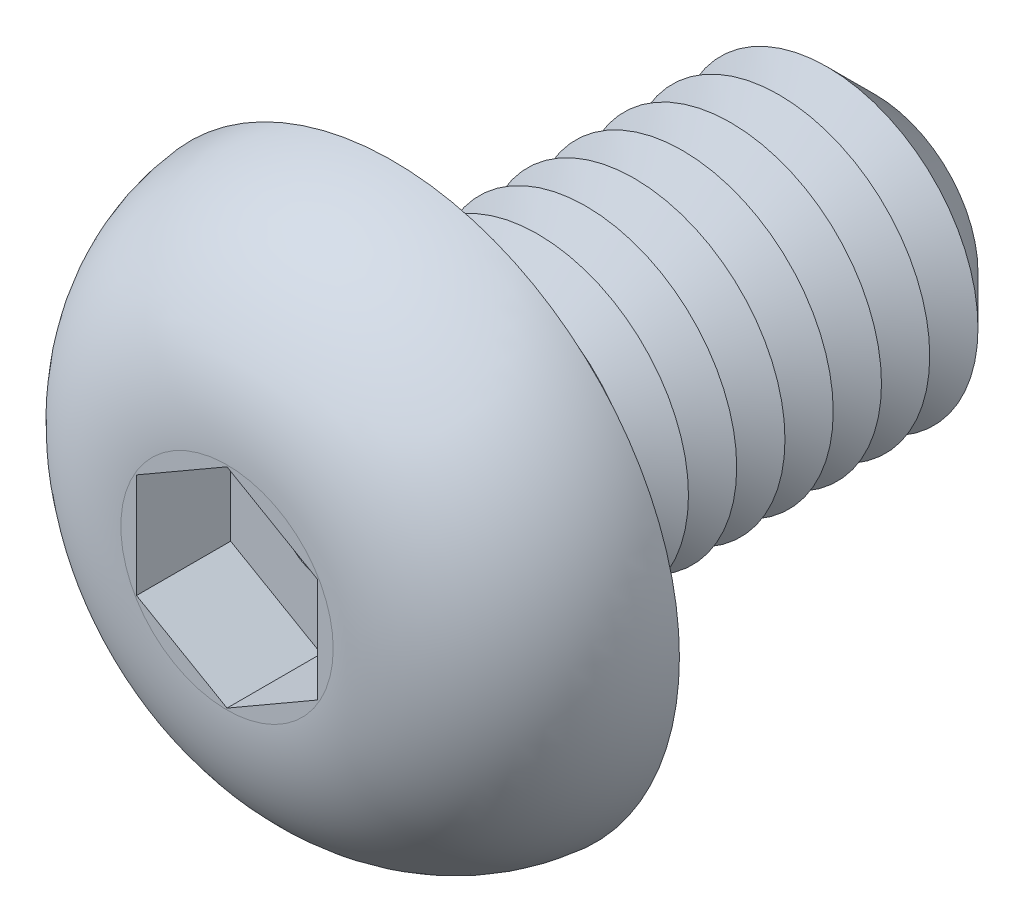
ISO-10303-21;
HEADER;
FILE_DESCRIPTION(('STEP AP214'),'2;1');
FILE_NAME('part.step','',(''),(''),'','','');
FILE_SCHEMA(('AUTOMOTIVE_DESIGN { 1 0 10303 214 1 1 1 1 }'));
ENDSEC;
DATA;
#1=APPLICATION_CONTEXT('core data for automotive mechanical design processes');
#2=APPLICATION_PROTOCOL_DEFINITION('international standard','automotive_design',2000,#1);
#3=PRODUCT_CONTEXT('',#1,'mechanical');
#4=PRODUCT('Part','Part','',(#3));
#5=PRODUCT_RELATED_PRODUCT_CATEGORY('part','',(#4));
#6=PRODUCT_DEFINITION_FORMATION('','',#4);
#7=PRODUCT_DEFINITION_CONTEXT('part definition',#1,'design');
#8=PRODUCT_DEFINITION('design','',#6,#7);
#9=PRODUCT_DEFINITION_SHAPE('','',#8);
#10=(LENGTH_UNIT() NAMED_UNIT(*) SI_UNIT(.MILLI.,.METRE.));
#11=(NAMED_UNIT(*) PLANE_ANGLE_UNIT() SI_UNIT($,.RADIAN.));
#12=(NAMED_UNIT(*) SI_UNIT($,.STERADIAN.) SOLID_ANGLE_UNIT());
#13=UNCERTAINTY_MEASURE_WITH_UNIT(LENGTH_MEASURE(1.E-05),#10,'distance_accuracy_value','');
#14=(GEOMETRIC_REPRESENTATION_CONTEXT(3) GLOBAL_UNCERTAINTY_ASSIGNED_CONTEXT((#13)) GLOBAL_UNIT_ASSIGNED_CONTEXT((#10,
#11,#12)) REPRESENTATION_CONTEXT('',''));
#15=CARTESIAN_POINT('',(0.,0.,0.));
#16=DIRECTION('',(0.,0.,1.));
#17=DIRECTION('',(1.,0.,0.));
#18=AXIS2_PLACEMENT_3D('',#15,#16,#17);
#19=CARTESIAN_POINT('',(0.,0.,-8.));
#20=DIRECTION('',(0.,0.,1.));
#21=DIRECTION('',(1.,0.,0.));
#22=AXIS2_PLACEMENT_3D('',#19,#20,#21);
#23=CYLINDRICAL_SURFACE('',#22,2.5);
#24=CARTESIAN_POINT('',(0.,0.,-0.4));
#25=DIRECTION('',(0.,0.,1.));
#26=DIRECTION('',(1.,0.,0.));
#27=AXIS2_PLACEMENT_3D('',#24,#25,#26);
#28=CIRCLE('',#27,2.5);
#29=CARTESIAN_POINT('',(2.5,0.,-0.4));
#30=VERTEX_POINT('',#29);
#31=EDGE_CURVE('E48',#30,#30,#28,.F.);
#32=ORIENTED_EDGE('',*,*,#31,.T.);
#33=EDGE_LOOP('',(#32));
#34=FACE_BOUND('',#33,.T.);
#35=CARTESIAN_POINT('',(0.,0.,-0.800000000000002));
#36=DIRECTION('',(0.,0.,1.));
#37=DIRECTION('',(1.,0.,0.));
#38=AXIS2_PLACEMENT_3D('',#35,#36,#37);
#39=CIRCLE('',#38,2.5);
#40=CARTESIAN_POINT('',(2.5,0.,-0.800000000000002));
#41=VERTEX_POINT('',#40);
#42=EDGE_CURVE('E138',#41,#41,#39,.T.);
#43=ORIENTED_EDGE('',*,*,#42,.T.);
#44=EDGE_LOOP('',(#43));
#45=FACE_BOUND('',#44,.T.);
#46=ADVANCED_FACE('F39',(#34,#45),#23,.T.);
#47=CARTESIAN_POINT('',(0.,4.75,0.));
#48=DIRECTION('',(0.,0.,1.));
#49=DIRECTION('',(1.,0.,0.));
#50=AXIS2_PLACEMENT_3D('',#47,#48,#49);
#51=PLANE('',#50);
#52=CARTESIAN_POINT('',(0.,0.,0.));
#53=DIRECTION('',(0.,0.,1.));
#54=DIRECTION('',(1.,0.,0.));
#55=AXIS2_PLACEMENT_3D('',#52,#53,#54);
#56=CIRCLE('',#55,2.9);
#57=CARTESIAN_POINT('',(2.9,0.,0.));
#58=VERTEX_POINT('',#57);
#59=EDGE_CURVE('E11',#58,#58,#56,.T.);
#60=ORIENTED_EDGE('',*,*,#59,.T.);
#61=EDGE_LOOP('',(#60));
#62=FACE_BOUND('',#61,.T.);
#63=CARTESIAN_POINT('',(0.,0.,0.));
#64=DIRECTION('',(0.,0.,1.));
#65=DIRECTION('',(1.,0.,0.));
#66=AXIS2_PLACEMENT_3D('',#63,#64,#65);
#67=CIRCLE('',#66,4.75);
#68=CARTESIAN_POINT('',(4.75,0.,0.));
#69=VERTEX_POINT('',#68);
#70=EDGE_CURVE('E156',#69,#69,#67,.T.);
#71=ORIENTED_EDGE('',*,*,#70,.F.);
#72=EDGE_LOOP('',(#71));
#73=FACE_BOUND('',#72,.T.);
#74=ADVANCED_FACE('F198',(#62,#73),#51,.F.);
#75=CARTESIAN_POINT('',(0.,0.,2.75));
#76=DIRECTION('',(0.,0.,-1.));
#77=DIRECTION('',(-1.,0.,0.));
#78=AXIS2_PLACEMENT_3D('',#75,#76,#77);
#79=PLANE('',#78);
#80=DIRECTION('',(-0.866025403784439,-0.5,0.));
#81=VECTOR('',#80,1.);
#82=CARTESIAN_POINT('',(0.,1.73205080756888,2.75));
#83=LINE('',#82,#81);
#84=CARTESIAN_POINT('',(0.,1.73205080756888,2.75));
#85=VERTEX_POINT('',#84);
#86=CARTESIAN_POINT('',(-1.5,0.866025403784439,2.75));
#87=VERTEX_POINT('',#86);
#88=EDGE_CURVE('E137',#85,#87,#83,.T.);
#89=ORIENTED_EDGE('',*,*,#88,.F.);
#90=DIRECTION('',(-0.866025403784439,0.5,0.));
#91=VECTOR('',#90,1.);
#92=CARTESIAN_POINT('',(1.5,0.86602540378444,2.75));
#93=LINE('',#92,#91);
#94=CARTESIAN_POINT('',(1.5,0.86602540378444,2.75));
#95=VERTEX_POINT('',#94);
#96=EDGE_CURVE('E55',#95,#85,#93,.T.);
#97=ORIENTED_EDGE('',*,*,#96,.F.);
#98=DIRECTION('',(0.,1.,0.));
#99=VECTOR('',#98,1.);
#100=CARTESIAN_POINT('',(1.5,-0.866025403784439,2.75));
#101=LINE('',#100,#99);
#102=CARTESIAN_POINT('',(1.5,-0.866025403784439,2.75));
#103=VERTEX_POINT('',#102);
#104=EDGE_CURVE('E150',#103,#95,#101,.T.);
#105=ORIENTED_EDGE('',*,*,#104,.F.);
#106=DIRECTION('',(0.866025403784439,0.5,0.));
#107=VECTOR('',#106,1.);
#108=CARTESIAN_POINT('',(0.,-1.73205080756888,2.75));
#109=LINE('',#108,#107);
#110=CARTESIAN_POINT('',(0.,-1.73205080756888,2.75));
#111=VERTEX_POINT('',#110);
#112=EDGE_CURVE('E147',#111,#103,#109,.T.);
#113=ORIENTED_EDGE('',*,*,#112,.F.);
#114=DIRECTION('',(0.866025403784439,-0.5,0.));
#115=VECTOR('',#114,1.);
#116=CARTESIAN_POINT('',(-1.5,-0.866025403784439,2.75));
#117=LINE('',#116,#115);
#118=CARTESIAN_POINT('',(-1.5,-0.866025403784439,2.75));
#119=VERTEX_POINT('',#118);
#120=EDGE_CURVE('E103',#119,#111,#117,.T.);
#121=ORIENTED_EDGE('',*,*,#120,.F.);
#122=DIRECTION('',(0.,-1.,0.));
#123=VECTOR('',#122,1.);
#124=CARTESIAN_POINT('',(-1.5,0.866025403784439,2.75));
#125=LINE('',#124,#123);
#126=EDGE_CURVE('E142',#87,#119,#125,.T.);
#127=ORIENTED_EDGE('',*,*,#126,.F.);
#128=EDGE_LOOP('',(#89,#97,#105,#113,#121,#127));
#129=FACE_BOUND('',#128,.T.);
#130=CARTESIAN_POINT('',(0.,0.,2.75));
#131=DIRECTION('',(0.,0.,1.));
#132=DIRECTION('',(1.,0.,0.));
#133=AXIS2_PLACEMENT_3D('',#130,#131,#132);
#134=CIRCLE('',#133,1.76043481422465);
#135=CARTESIAN_POINT('',(1.76043481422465,0.,2.75));
#136=VERTEX_POINT('',#135);
#137=EDGE_CURVE('E169',#136,#136,#134,.T.);
#138=ORIENTED_EDGE('',*,*,#137,.T.);
#139=EDGE_LOOP('',(#138));
#140=FACE_BOUND('',#139,.T.);
#141=ADVANCED_FACE('F203',(#129,#140),#79,.F.);
#142=CARTESIAN_POINT('',(0.,0.,-0.25));
#143=DIRECTION('',(0.,0.,1.));
#144=DIRECTION('',(1.,0.,0.));
#145=AXIS2_PLACEMENT_3D('',#142,#143,#144);
#146=DEGENERATE_TOROIDAL_SURFACE('',#145,1.76043481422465,3.,.T.);
#147=ORIENTED_EDGE('',*,*,#137,.F.);
#148=EDGE_LOOP('',(#147));
#149=FACE_BOUND('',#148,.T.);
#150=ORIENTED_EDGE('',*,*,#70,.T.);
#151=EDGE_LOOP('',(#150));
#152=FACE_BOUND('',#151,.T.);
#153=ADVANCED_FACE('F231',(#149,#152),#146,.T.);
#154=CARTESIAN_POINT('',(1.5,0.86602540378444,1.19));
#155=DIRECTION('',(0.5,0.866025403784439,0.));
#156=DIRECTION('',(-0.866025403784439,0.5,0.));
#157=AXIS2_PLACEMENT_3D('',#154,#155,#156);
#158=PLANE('',#157);
#159=ORIENTED_EDGE('',*,*,#96,.T.);
#160=DIRECTION('',(0.,0.,1.));
#161=VECTOR('',#160,1.);
#162=CARTESIAN_POINT('',(0.,1.73205080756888,1.19));
#163=LINE('',#162,#161);
#164=CARTESIAN_POINT('',(0.,1.73205080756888,1.19));
#165=VERTEX_POINT('',#164);
#166=EDGE_CURVE('E85',#165,#85,#163,.T.);
#167=ORIENTED_EDGE('',*,*,#166,.F.);
#168=DIRECTION('',(-0.866025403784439,0.5,0.));
#169=VECTOR('',#168,1.);
#170=CARTESIAN_POINT('',(1.5,0.86602540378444,1.19));
#171=LINE('',#170,#169);
#172=CARTESIAN_POINT('',(1.5,0.86602540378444,1.19));
#173=VERTEX_POINT('',#172);
#174=EDGE_CURVE('E153',#173,#165,#171,.T.);
#175=ORIENTED_EDGE('',*,*,#174,.F.);
#176=DIRECTION('',(0.,0.,1.));
#177=VECTOR('',#176,1.);
#178=CARTESIAN_POINT('',(1.5,0.86602540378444,1.19));
#179=LINE('',#178,#177);
#180=EDGE_CURVE('E63',#173,#95,#179,.T.);
#181=ORIENTED_EDGE('',*,*,#180,.T.);
#182=EDGE_LOOP('',(#159,#167,#175,#181));
#183=FACE_BOUND('',#182,.T.);
#184=ADVANCED_FACE('F217',(#183),#158,.F.);
#185=CARTESIAN_POINT('',(1.5,-0.866025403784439,1.19));
#186=DIRECTION('',(1.,0.,0.));
#187=DIRECTION('',(0.,1.,0.));
#188=AXIS2_PLACEMENT_3D('',#185,#186,#187);
#189=PLANE('',#188);
#190=ORIENTED_EDGE('',*,*,#104,.T.);
#191=ORIENTED_EDGE('',*,*,#180,.F.);
#192=DIRECTION('',(0.,1.,0.));
#193=VECTOR('',#192,1.);
#194=CARTESIAN_POINT('',(1.5,-0.866025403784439,1.19));
#195=LINE('',#194,#193);
#196=CARTESIAN_POINT('',(1.5,-0.866025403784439,1.19));
#197=VERTEX_POINT('',#196);
#198=EDGE_CURVE('E117',#197,#173,#195,.T.);
#199=ORIENTED_EDGE('',*,*,#198,.F.);
#200=DIRECTION('',(0.,0.,1.));
#201=VECTOR('',#200,1.);
#202=CARTESIAN_POINT('',(1.5,-0.866025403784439,1.19));
#203=LINE('',#202,#201);
#204=EDGE_CURVE('E108',#197,#103,#203,.T.);
#205=ORIENTED_EDGE('',*,*,#204,.T.);
#206=EDGE_LOOP('',(#190,#191,#199,#205));
#207=FACE_BOUND('',#206,.T.);
#208=ADVANCED_FACE('F214',(#207),#189,.F.);
#209=CARTESIAN_POINT('',(0.,-1.73205080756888,1.19));
#210=DIRECTION('',(0.5,-0.866025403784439,0.));
#211=DIRECTION('',(0.866025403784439,0.5,0.));
#212=AXIS2_PLACEMENT_3D('',#209,#210,#211);
#213=PLANE('',#212);
#214=ORIENTED_EDGE('',*,*,#112,.T.);
#215=ORIENTED_EDGE('',*,*,#204,.F.);
#216=DIRECTION('',(0.866025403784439,0.5,0.));
#217=VECTOR('',#216,1.);
#218=CARTESIAN_POINT('',(0.,-1.73205080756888,1.19));
#219=LINE('',#218,#217);
#220=CARTESIAN_POINT('',(0.,-1.73205080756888,1.19));
#221=VERTEX_POINT('',#220);
#222=EDGE_CURVE('E112',#221,#197,#219,.T.);
#223=ORIENTED_EDGE('',*,*,#222,.F.);
#224=DIRECTION('',(0.,0.,1.));
#225=VECTOR('',#224,1.);
#226=CARTESIAN_POINT('',(0.,-1.73205080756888,1.19));
#227=LINE('',#226,#225);
#228=EDGE_CURVE('E96',#221,#111,#227,.T.);
#229=ORIENTED_EDGE('',*,*,#228,.T.);
#230=EDGE_LOOP('',(#214,#215,#223,#229));
#231=FACE_BOUND('',#230,.T.);
#232=ADVANCED_FACE('F113',(#231),#213,.F.);
#233=CARTESIAN_POINT('',(-1.5,-0.866025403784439,1.19));
#234=DIRECTION('',(-0.5,-0.866025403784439,0.));
#235=DIRECTION('',(0.866025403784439,-0.5,0.));
#236=AXIS2_PLACEMENT_3D('',#233,#234,#235);
#237=PLANE('',#236);
#238=ORIENTED_EDGE('',*,*,#120,.T.);
#239=ORIENTED_EDGE('',*,*,#228,.F.);
#240=DIRECTION('',(0.866025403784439,-0.5,0.));
#241=VECTOR('',#240,1.);
#242=CARTESIAN_POINT('',(-1.5,-0.866025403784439,1.19));
#243=LINE('',#242,#241);
#244=CARTESIAN_POINT('',(-1.5,-0.866025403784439,1.19));
#245=VERTEX_POINT('',#244);
#246=EDGE_CURVE('E100',#245,#221,#243,.T.);
#247=ORIENTED_EDGE('',*,*,#246,.F.);
#248=DIRECTION('',(0.,0.,1.));
#249=VECTOR('',#248,1.);
#250=CARTESIAN_POINT('',(-1.5,-0.866025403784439,1.19));
#251=LINE('',#250,#249);
#252=EDGE_CURVE('E109',#245,#119,#251,.T.);
#253=ORIENTED_EDGE('',*,*,#252,.T.);
#254=EDGE_LOOP('',(#238,#239,#247,#253));
#255=FACE_BOUND('',#254,.T.);
#256=ADVANCED_FACE('F98',(#255),#237,.F.);
#257=CARTESIAN_POINT('',(-1.5,0.866025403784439,1.19));
#258=DIRECTION('',(-1.,0.,0.));
#259=DIRECTION('',(0.,-1.,0.));
#260=AXIS2_PLACEMENT_3D('',#257,#258,#259);
#261=PLANE('',#260);
#262=ORIENTED_EDGE('',*,*,#126,.T.);
#263=ORIENTED_EDGE('',*,*,#252,.F.);
#264=DIRECTION('',(0.,-1.,0.));
#265=VECTOR('',#264,1.);
#266=CARTESIAN_POINT('',(-1.5,0.866025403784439,1.19));
#267=LINE('',#266,#265);
#268=CARTESIAN_POINT('',(-1.5,0.866025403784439,1.19));
#269=VERTEX_POINT('',#268);
#270=EDGE_CURVE('E123',#269,#245,#267,.T.);
#271=ORIENTED_EDGE('',*,*,#270,.F.);
#272=DIRECTION('',(0.,0.,1.));
#273=VECTOR('',#272,1.);
#274=CARTESIAN_POINT('',(-1.5,0.866025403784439,1.19));
#275=LINE('',#274,#273);
#276=EDGE_CURVE('E161',#269,#87,#275,.T.);
#277=ORIENTED_EDGE('',*,*,#276,.T.);
#278=EDGE_LOOP('',(#262,#263,#271,#277));
#279=FACE_BOUND('',#278,.T.);
#280=ADVANCED_FACE('F222',(#279),#261,.F.);
#281=CARTESIAN_POINT('',(0.,1.73205080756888,1.19));
#282=DIRECTION('',(-0.5,0.866025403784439,0.));
#283=DIRECTION('',(-0.866025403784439,-0.5,0.));
#284=AXIS2_PLACEMENT_3D('',#281,#282,#283);
#285=PLANE('',#284);
#286=ORIENTED_EDGE('',*,*,#88,.T.);
#287=ORIENTED_EDGE('',*,*,#276,.F.);
#288=DIRECTION('',(-0.866025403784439,-0.5,0.));
#289=VECTOR('',#288,1.);
#290=CARTESIAN_POINT('',(0.,1.73205080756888,1.19));
#291=LINE('',#290,#289);
#292=EDGE_CURVE('E129',#165,#269,#291,.T.);
#293=ORIENTED_EDGE('',*,*,#292,.F.);
#294=ORIENTED_EDGE('',*,*,#166,.T.);
#295=EDGE_LOOP('',(#286,#287,#293,#294));
#296=FACE_BOUND('',#295,.T.);
#297=ADVANCED_FACE('F212',(#296),#285,.F.);
#298=CARTESIAN_POINT('',(0.,0.,1.19));
#299=DIRECTION('',(0.,0.,1.));
#300=DIRECTION('',(1.,0.,0.));
#301=AXIS2_PLACEMENT_3D('',#298,#299,#300);
#302=PLANE('',#301);
#303=CARTESIAN_POINT('',(0.,0.,1.19));
#304=DIRECTION('',(0.,0.,1.));
#305=DIRECTION('',(1.,0.,0.));
#306=AXIS2_PLACEMENT_3D('',#303,#304,#305);
#307=CIRCLE('',#306,0.65);
#308=CARTESIAN_POINT('',(0.65,0.,1.19));
#309=VERTEX_POINT('',#308);
#310=EDGE_CURVE('E319',#309,#309,#307,.T.);
#311=ORIENTED_EDGE('',*,*,#310,.F.);
#312=EDGE_LOOP('',(#311));
#313=FACE_BOUND('',#312,.T.);
#314=ORIENTED_EDGE('',*,*,#174,.T.);
#315=ORIENTED_EDGE('',*,*,#292,.T.);
#316=ORIENTED_EDGE('',*,*,#270,.T.);
#317=ORIENTED_EDGE('',*,*,#246,.T.);
#318=ORIENTED_EDGE('',*,*,#222,.T.);
#319=ORIENTED_EDGE('',*,*,#198,.T.);
#320=EDGE_LOOP('',(#314,#315,#316,#317,#318,#319));
#321=FACE_BOUND('',#320,.T.);
#322=ADVANCED_FACE('F120',(#313,#321),#302,.T.);
#323=CARTESIAN_POINT('',(0.,0.,-0.800000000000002));
#324=DIRECTION('',(0.,0.,1.));
#325=DIRECTION('',(1.,0.,0.));
#326=AXIS2_PLACEMENT_3D('',#323,#324,#325);
#327=CONICAL_SURFACE('',#326,2.5,1.0471975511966);
#328=CARTESIAN_POINT('',(0.,0.,-1.2));
#329=DIRECTION('',(0.,0.,1.));
#330=DIRECTION('',(1.,0.,0.));
#331=AXIS2_PLACEMENT_3D('',#328,#329,#330);
#332=CIRCLE('',#331,1.80717967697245);
#333=CARTESIAN_POINT('',(1.80717967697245,0.,-1.2));
#334=VERTEX_POINT('',#333);
#335=EDGE_CURVE('E253',#334,#334,#332,.T.);
#336=ORIENTED_EDGE('',*,*,#335,.T.);
#337=EDGE_LOOP('',(#336));
#338=FACE_BOUND('',#337,.T.);
#339=ORIENTED_EDGE('',*,*,#42,.F.);
#340=EDGE_LOOP('',(#339));
#341=FACE_BOUND('',#340,.T.);
#342=ADVANCED_FACE('F211',(#338,#341),#327,.T.);
#343=CARTESIAN_POINT('',(0.,0.,-1.2));
#344=DIRECTION('',(0.,0.,-1.));
#345=DIRECTION('',(-1.,0.,0.));
#346=AXIS2_PLACEMENT_3D('',#343,#344,#345);
#347=CONICAL_SURFACE('',#346,1.80717967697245,1.0471975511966);
#348=CARTESIAN_POINT('',(0.,0.,-1.6));
#349=DIRECTION('',(0.,0.,1.));
#350=DIRECTION('',(1.,0.,0.));
#351=AXIS2_PLACEMENT_3D('',#348,#349,#350);
#352=CIRCLE('',#351,2.5);
#353=CARTESIAN_POINT('',(2.5,0.,-1.6));
#354=VERTEX_POINT('',#353);
#355=EDGE_CURVE('E257',#354,#354,#352,.T.);
#356=ORIENTED_EDGE('',*,*,#355,.T.);
#357=EDGE_LOOP('',(#356));
#358=FACE_BOUND('',#357,.T.);
#359=ORIENTED_EDGE('',*,*,#335,.F.);
#360=EDGE_LOOP('',(#359));
#361=FACE_BOUND('',#360,.T.);
#362=ADVANCED_FACE('F391',(#358,#361),#347,.T.);
#363=CARTESIAN_POINT('',(0.,0.,-1.6));
#364=DIRECTION('',(0.,0.,1.));
#365=DIRECTION('',(1.,0.,0.));
#366=AXIS2_PLACEMENT_3D('',#363,#364,#365);
#367=CONICAL_SURFACE('',#366,2.5,1.0471975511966);
#368=CARTESIAN_POINT('',(0.,0.,-2.));
#369=DIRECTION('',(0.,0.,1.));
#370=DIRECTION('',(1.,0.,0.));
#371=AXIS2_PLACEMENT_3D('',#368,#369,#370);
#372=CIRCLE('',#371,1.80717967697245);
#373=CARTESIAN_POINT('',(1.80717967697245,0.,-2.));
#374=VERTEX_POINT('',#373);
#375=EDGE_CURVE('E261',#374,#374,#372,.T.);
#376=ORIENTED_EDGE('',*,*,#375,.T.);
#377=EDGE_LOOP('',(#376));
#378=FACE_BOUND('',#377,.T.);
#379=ORIENTED_EDGE('',*,*,#355,.F.);
#380=EDGE_LOOP('',(#379));
#381=FACE_BOUND('',#380,.T.);
#382=ADVANCED_FACE('F387',(#378,#381),#367,.T.);
#383=CARTESIAN_POINT('',(0.,0.,-2.));
#384=DIRECTION('',(0.,0.,-1.));
#385=DIRECTION('',(-1.,0.,0.));
#386=AXIS2_PLACEMENT_3D('',#383,#384,#385);
#387=CONICAL_SURFACE('',#386,1.80717967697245,1.0471975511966);
#388=CARTESIAN_POINT('',(0.,0.,-2.4));
#389=DIRECTION('',(0.,0.,1.));
#390=DIRECTION('',(1.,0.,0.));
#391=AXIS2_PLACEMENT_3D('',#388,#389,#390);
#392=CIRCLE('',#391,2.5);
#393=CARTESIAN_POINT('',(2.5,0.,-2.4));
#394=VERTEX_POINT('',#393);
#395=EDGE_CURVE('E265',#394,#394,#392,.T.);
#396=ORIENTED_EDGE('',*,*,#395,.T.);
#397=EDGE_LOOP('',(#396));
#398=FACE_BOUND('',#397,.T.);
#399=ORIENTED_EDGE('',*,*,#375,.F.);
#400=EDGE_LOOP('',(#399));
#401=FACE_BOUND('',#400,.T.);
#402=ADVANCED_FACE('F383',(#398,#401),#387,.T.);
#403=CARTESIAN_POINT('',(0.,0.,-2.4));
#404=DIRECTION('',(0.,0.,1.));
#405=DIRECTION('',(1.,0.,0.));
#406=AXIS2_PLACEMENT_3D('',#403,#404,#405);
#407=CONICAL_SURFACE('',#406,2.5,1.0471975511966);
#408=CARTESIAN_POINT('',(0.,0.,-2.8));
#409=DIRECTION('',(0.,0.,1.));
#410=DIRECTION('',(1.,0.,0.));
#411=AXIS2_PLACEMENT_3D('',#408,#409,#410);
#412=CIRCLE('',#411,1.80717967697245);
#413=CARTESIAN_POINT('',(1.80717967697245,0.,-2.8));
#414=VERTEX_POINT('',#413);
#415=EDGE_CURVE('E269',#414,#414,#412,.T.);
#416=ORIENTED_EDGE('',*,*,#415,.T.);
#417=EDGE_LOOP('',(#416));
#418=FACE_BOUND('',#417,.T.);
#419=ORIENTED_EDGE('',*,*,#395,.F.);
#420=EDGE_LOOP('',(#419));
#421=FACE_BOUND('',#420,.T.);
#422=ADVANCED_FACE('F379',(#418,#421),#407,.T.);
#423=CARTESIAN_POINT('',(0.,0.,-2.8));
#424=DIRECTION('',(0.,0.,-1.));
#425=DIRECTION('',(-1.,0.,0.));
#426=AXIS2_PLACEMENT_3D('',#423,#424,#425);
#427=CONICAL_SURFACE('',#426,1.80717967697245,1.0471975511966);
#428=CARTESIAN_POINT('',(0.,0.,-3.2));
#429=DIRECTION('',(0.,0.,1.));
#430=DIRECTION('',(1.,0.,0.));
#431=AXIS2_PLACEMENT_3D('',#428,#429,#430);
#432=CIRCLE('',#431,2.5);
#433=CARTESIAN_POINT('',(2.5,0.,-3.2));
#434=VERTEX_POINT('',#433);
#435=EDGE_CURVE('E273',#434,#434,#432,.T.);
#436=ORIENTED_EDGE('',*,*,#435,.T.);
#437=EDGE_LOOP('',(#436));
#438=FACE_BOUND('',#437,.T.);
#439=ORIENTED_EDGE('',*,*,#415,.F.);
#440=EDGE_LOOP('',(#439));
#441=FACE_BOUND('',#440,.T.);
#442=ADVANCED_FACE('F375',(#438,#441),#427,.T.);
#443=CARTESIAN_POINT('',(0.,0.,-3.2));
#444=DIRECTION('',(0.,0.,1.));
#445=DIRECTION('',(1.,0.,0.));
#446=AXIS2_PLACEMENT_3D('',#443,#444,#445);
#447=CONICAL_SURFACE('',#446,2.5,1.0471975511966);
#448=CARTESIAN_POINT('',(0.,0.,-3.6));
#449=DIRECTION('',(0.,0.,1.));
#450=DIRECTION('',(1.,0.,0.));
#451=AXIS2_PLACEMENT_3D('',#448,#449,#450);
#452=CIRCLE('',#451,1.80717967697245);
#453=CARTESIAN_POINT('',(1.80717967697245,0.,-3.6));
#454=VERTEX_POINT('',#453);
#455=EDGE_CURVE('E277',#454,#454,#452,.T.);
#456=ORIENTED_EDGE('',*,*,#455,.T.);
#457=EDGE_LOOP('',(#456));
#458=FACE_BOUND('',#457,.T.);
#459=ORIENTED_EDGE('',*,*,#435,.F.);
#460=EDGE_LOOP('',(#459));
#461=FACE_BOUND('',#460,.T.);
#462=ADVANCED_FACE('F371',(#458,#461),#447,.T.);
#463=CARTESIAN_POINT('',(0.,0.,-3.6));
#464=DIRECTION('',(0.,0.,-1.));
#465=DIRECTION('',(-1.,0.,0.));
#466=AXIS2_PLACEMENT_3D('',#463,#464,#465);
#467=CONICAL_SURFACE('',#466,1.80717967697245,1.0471975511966);
#468=CARTESIAN_POINT('',(0.,0.,-4.));
#469=DIRECTION('',(0.,0.,1.));
#470=DIRECTION('',(1.,0.,0.));
#471=AXIS2_PLACEMENT_3D('',#468,#469,#470);
#472=CIRCLE('',#471,2.5);
#473=CARTESIAN_POINT('',(2.5,0.,-4.));
#474=VERTEX_POINT('',#473);
#475=EDGE_CURVE('E280',#474,#474,#472,.T.);
#476=ORIENTED_EDGE('',*,*,#475,.T.);
#477=EDGE_LOOP('',(#476));
#478=FACE_BOUND('',#477,.T.);
#479=ORIENTED_EDGE('',*,*,#455,.F.);
#480=EDGE_LOOP('',(#479));
#481=FACE_BOUND('',#480,.T.);
#482=ADVANCED_FACE('F367',(#478,#481),#467,.T.);
#483=CARTESIAN_POINT('',(0.,0.,-4.));
#484=DIRECTION('',(0.,0.,1.));
#485=DIRECTION('',(1.,0.,0.));
#486=AXIS2_PLACEMENT_3D('',#483,#484,#485);
#487=CONICAL_SURFACE('',#486,2.5,1.0471975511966);
#488=CARTESIAN_POINT('',(0.,0.,-4.4));
#489=DIRECTION('',(0.,0.,1.));
#490=DIRECTION('',(1.,0.,0.));
#491=AXIS2_PLACEMENT_3D('',#488,#489,#490);
#492=CIRCLE('',#491,1.80717967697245);
#493=CARTESIAN_POINT('',(1.80717967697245,0.,-4.4));
#494=VERTEX_POINT('',#493);
#495=EDGE_CURVE('E284',#494,#494,#492,.T.);
#496=ORIENTED_EDGE('',*,*,#495,.T.);
#497=EDGE_LOOP('',(#496));
#498=FACE_BOUND('',#497,.T.);
#499=ORIENTED_EDGE('',*,*,#475,.F.);
#500=EDGE_LOOP('',(#499));
#501=FACE_BOUND('',#500,.T.);
#502=ADVANCED_FACE('F363',(#498,#501),#487,.T.);
#503=CARTESIAN_POINT('',(0.,0.,-4.4));
#504=DIRECTION('',(0.,0.,-1.));
#505=DIRECTION('',(-1.,0.,0.));
#506=AXIS2_PLACEMENT_3D('',#503,#504,#505);
#507=CONICAL_SURFACE('',#506,1.80717967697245,1.0471975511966);
#508=CARTESIAN_POINT('',(0.,0.,-4.8));
#509=DIRECTION('',(0.,0.,1.));
#510=DIRECTION('',(1.,0.,0.));
#511=AXIS2_PLACEMENT_3D('',#508,#509,#510);
#512=CIRCLE('',#511,2.5);
#513=CARTESIAN_POINT('',(2.5,0.,-4.8));
#514=VERTEX_POINT('',#513);
#515=EDGE_CURVE('E288',#514,#514,#512,.T.);
#516=ORIENTED_EDGE('',*,*,#515,.T.);
#517=EDGE_LOOP('',(#516));
#518=FACE_BOUND('',#517,.T.);
#519=ORIENTED_EDGE('',*,*,#495,.F.);
#520=EDGE_LOOP('',(#519));
#521=FACE_BOUND('',#520,.T.);
#522=ADVANCED_FACE('F359',(#518,#521),#507,.T.);
#523=CARTESIAN_POINT('',(0.,0.,-4.8));
#524=DIRECTION('',(0.,0.,1.));
#525=DIRECTION('',(1.,0.,0.));
#526=AXIS2_PLACEMENT_3D('',#523,#524,#525);
#527=CONICAL_SURFACE('',#526,2.5,1.0471975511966);
#528=CARTESIAN_POINT('',(0.,0.,-5.2));
#529=DIRECTION('',(0.,0.,1.));
#530=DIRECTION('',(1.,0.,0.));
#531=AXIS2_PLACEMENT_3D('',#528,#529,#530);
#532=CIRCLE('',#531,1.80717967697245);
#533=CARTESIAN_POINT('',(1.80717967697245,0.,-5.2));
#534=VERTEX_POINT('',#533);
#535=EDGE_CURVE('E292',#534,#534,#532,.T.);
#536=ORIENTED_EDGE('',*,*,#535,.T.);
#537=EDGE_LOOP('',(#536));
#538=FACE_BOUND('',#537,.T.);
#539=ORIENTED_EDGE('',*,*,#515,.F.);
#540=EDGE_LOOP('',(#539));
#541=FACE_BOUND('',#540,.T.);
#542=ADVANCED_FACE('F355',(#538,#541),#527,.T.);
#543=CARTESIAN_POINT('',(0.,0.,-5.2));
#544=DIRECTION('',(0.,0.,-1.));
#545=DIRECTION('',(-1.,0.,0.));
#546=AXIS2_PLACEMENT_3D('',#543,#544,#545);
#547=CONICAL_SURFACE('',#546,1.80717967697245,1.0471975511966);
#548=CARTESIAN_POINT('',(0.,0.,-5.6));
#549=DIRECTION('',(0.,0.,1.));
#550=DIRECTION('',(1.,0.,0.));
#551=AXIS2_PLACEMENT_3D('',#548,#549,#550);
#552=CIRCLE('',#551,2.5);
#553=CARTESIAN_POINT('',(2.5,0.,-5.6));
#554=VERTEX_POINT('',#553);
#555=EDGE_CURVE('E296',#554,#554,#552,.T.);
#556=ORIENTED_EDGE('',*,*,#555,.T.);
#557=EDGE_LOOP('',(#556));
#558=FACE_BOUND('',#557,.T.);
#559=ORIENTED_EDGE('',*,*,#535,.F.);
#560=EDGE_LOOP('',(#559));
#561=FACE_BOUND('',#560,.T.);
#562=ADVANCED_FACE('F351',(#558,#561),#547,.T.);
#563=CARTESIAN_POINT('',(0.,0.,-5.6));
#564=DIRECTION('',(0.,0.,1.));
#565=DIRECTION('',(1.,0.,0.));
#566=AXIS2_PLACEMENT_3D('',#563,#564,#565);
#567=CONICAL_SURFACE('',#566,2.5,1.0471975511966);
#568=CARTESIAN_POINT('',(0.,0.,-6.));
#569=DIRECTION('',(0.,0.,1.));
#570=DIRECTION('',(1.,0.,0.));
#571=AXIS2_PLACEMENT_3D('',#568,#569,#570);
#572=CIRCLE('',#571,1.80717967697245);
#573=CARTESIAN_POINT('',(1.80717967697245,0.,-6.));
#574=VERTEX_POINT('',#573);
#575=EDGE_CURVE('E300',#574,#574,#572,.T.);
#576=ORIENTED_EDGE('',*,*,#575,.T.);
#577=EDGE_LOOP('',(#576));
#578=FACE_BOUND('',#577,.T.);
#579=ORIENTED_EDGE('',*,*,#555,.F.);
#580=EDGE_LOOP('',(#579));
#581=FACE_BOUND('',#580,.T.);
#582=ADVANCED_FACE('F347',(#578,#581),#567,.T.);
#583=CARTESIAN_POINT('',(0.,0.,-6.));
#584=DIRECTION('',(0.,0.,-1.));
#585=DIRECTION('',(-1.,0.,0.));
#586=AXIS2_PLACEMENT_3D('',#583,#584,#585);
#587=CONICAL_SURFACE('',#586,1.80717967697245,1.0471975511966);
#588=CARTESIAN_POINT('',(0.,0.,-6.4));
#589=DIRECTION('',(0.,0.,1.));
#590=DIRECTION('',(1.,0.,0.));
#591=AXIS2_PLACEMENT_3D('',#588,#589,#590);
#592=CIRCLE('',#591,2.5);
#593=CARTESIAN_POINT('',(2.5,0.,-6.4));
#594=VERTEX_POINT('',#593);
#595=EDGE_CURVE('E304',#594,#594,#592,.T.);
#596=ORIENTED_EDGE('',*,*,#595,.T.);
#597=EDGE_LOOP('',(#596));
#598=FACE_BOUND('',#597,.T.);
#599=ORIENTED_EDGE('',*,*,#575,.F.);
#600=EDGE_LOOP('',(#599));
#601=FACE_BOUND('',#600,.T.);
#602=ADVANCED_FACE('F340',(#598,#601),#587,.T.);
#603=CARTESIAN_POINT('',(0.,0.,-6.4));
#604=DIRECTION('',(0.,0.,1.));
#605=DIRECTION('',(1.,0.,0.));
#606=AXIS2_PLACEMENT_3D('',#603,#604,#605);
#607=CONICAL_SURFACE('',#606,2.5,1.0471975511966);
#608=CARTESIAN_POINT('',(0.,0.,-6.8));
#609=DIRECTION('',(0.,0.,1.));
#610=DIRECTION('',(1.,0.,0.));
#611=AXIS2_PLACEMENT_3D('',#608,#609,#610);
#612=CIRCLE('',#611,1.80717967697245);
#613=CARTESIAN_POINT('',(1.80717967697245,0.,-6.8));
#614=VERTEX_POINT('',#613);
#615=EDGE_CURVE('E312',#614,#614,#612,.T.);
#616=ORIENTED_EDGE('',*,*,#615,.T.);
#617=EDGE_LOOP('',(#616));
#618=FACE_BOUND('',#617,.T.);
#619=ORIENTED_EDGE('',*,*,#595,.F.);
#620=EDGE_LOOP('',(#619));
#621=FACE_BOUND('',#620,.T.);
#622=ADVANCED_FACE('F334',(#618,#621),#607,.T.);
#623=CARTESIAN_POINT('',(0.,0.,-6.8));
#624=DIRECTION('',(0.,0.,-1.));
#625=DIRECTION('',(-1.,0.,0.));
#626=AXIS2_PLACEMENT_3D('',#623,#624,#625);
#627=CONICAL_SURFACE('',#626,1.80717967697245,1.0471975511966);
#628=CARTESIAN_POINT('',(0.,0.,-7.2));
#629=DIRECTION('',(0.,0.,1.));
#630=DIRECTION('',(1.,0.,0.));
#631=AXIS2_PLACEMENT_3D('',#628,#629,#630);
#632=CIRCLE('',#631,2.5);
#633=CARTESIAN_POINT('',(2.5,0.,-7.2));
#634=VERTEX_POINT('',#633);
#635=EDGE_CURVE('E308',#634,#634,#632,.T.);
#636=ORIENTED_EDGE('',*,*,#635,.T.);
#637=EDGE_LOOP('',(#636));
#638=FACE_BOUND('',#637,.T.);
#639=ORIENTED_EDGE('',*,*,#615,.F.);
#640=EDGE_LOOP('',(#639));
#641=FACE_BOUND('',#640,.T.);
#642=ADVANCED_FACE('F328',(#638,#641),#627,.T.);
#643=CARTESIAN_POINT('',(0.,0.,-8.));
#644=DIRECTION('',(0.,0.,-1.));
#645=DIRECTION('',(-1.,0.,0.));
#646=AXIS2_PLACEMENT_3D('',#643,#644,#645);
#647=PLANE('',#646);
#648=CARTESIAN_POINT('',(0.,0.,-8.));
#649=DIRECTION('',(0.,0.,-1.));
#650=DIRECTION('',(-1.,0.,0.));
#651=AXIS2_PLACEMENT_3D('',#648,#649,#650);
#652=CIRCLE('',#651,0.65);
#653=CARTESIAN_POINT('',(-0.65,0.,-8.));
#654=VERTEX_POINT('',#653);
#655=EDGE_CURVE('E315',#654,#654,#652,.F.);
#656=ORIENTED_EDGE('',*,*,#655,.T.);
#657=EDGE_LOOP('',(#656));
#658=FACE_BOUND('',#657,.T.);
#659=CARTESIAN_POINT('',(0.,0.,-8.));
#660=DIRECTION('',(0.,0.,-1.));
#661=DIRECTION('',(-1.,0.,0.));
#662=AXIS2_PLACEMENT_3D('',#659,#660,#661);
#663=CIRCLE('',#662,1.7);
#664=CARTESIAN_POINT('',(-1.7,0.,-8.));
#665=VERTEX_POINT('',#664);
#666=EDGE_CURVE('E173',#665,#665,#663,.T.);
#667=ORIENTED_EDGE('',*,*,#666,.T.);
#668=EDGE_LOOP('',(#667));
#669=FACE_BOUND('',#668,.T.);
#670=ADVANCED_FACE('F194',(#658,#669),#647,.T.);
#671=CARTESIAN_POINT('',(0.,0.,-8.));
#672=DIRECTION('',(0.,0.,1.));
#673=DIRECTION('',(1.,0.,0.));
#674=AXIS2_PLACEMENT_3D('',#671,#672,#673);
#675=CONICAL_SURFACE('',#674,1.7,0.785398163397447);
#676=ORIENTED_EDGE('',*,*,#635,.F.);
#677=EDGE_LOOP('',(#676));
#678=FACE_BOUND('',#677,.T.);
#679=ORIENTED_EDGE('',*,*,#666,.F.);
#680=EDGE_LOOP('',(#679));
#681=FACE_BOUND('',#680,.T.);
#682=ADVANCED_FACE('F186',(#678,#681),#675,.T.);
#683=CARTESIAN_POINT('',(0.,0.,-0.4));
#684=DIRECTION('',(0.,0.,1.));
#685=DIRECTION('',(1.,0.,0.));
#686=AXIS2_PLACEMENT_3D('',#683,#684,#685);
#687=TOROIDAL_SURFACE('',#686,2.9,0.4);
#688=ORIENTED_EDGE('',*,*,#59,.F.);
#689=EDGE_LOOP('',(#688));
#690=FACE_BOUND('',#689,.T.);
#691=ORIENTED_EDGE('',*,*,#31,.F.);
#692=EDGE_LOOP('',(#691));
#693=FACE_BOUND('',#692,.T.);
#694=ADVANCED_FACE('F41',(#690,#693),#687,.F.);
#695=CARTESIAN_POINT('',(0.,0.,-9.83847763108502));
#696=DIRECTION('',(0.,0.,1.));
#697=DIRECTION('',(1.,0.,0.));
#698=AXIS2_PLACEMENT_3D('',#695,#696,#697);
#699=CYLINDRICAL_SURFACE('',#698,0.65);
#700=ORIENTED_EDGE('',*,*,#310,.T.);
#701=EDGE_LOOP('',(#700));
#702=FACE_BOUND('',#701,.T.);
#703=ORIENTED_EDGE('',*,*,#655,.F.);
#704=EDGE_LOOP('',(#703));
#705=FACE_BOUND('',#704,.T.);
#706=ADVANCED_FACE('F185',(#702,#705),#699,.F.);
#707=CLOSED_SHELL('',(#46,#74,#141,#153,#184,#208,#232,#256,#280,#297,#322,#342,#362,#382,#402,
#422,#442,#462,#482,#502,#522,#542,#562,#582,#602,#622,#642,#670,#682,#694,#706));
#708=MANIFOLD_SOLID_BREP('B2',#707);
#709=ADVANCED_BREP_SHAPE_REPRESENTATION('',(#18,#708),#14);
#710=SHAPE_DEFINITION_REPRESENTATION(#9,#709);
ENDSEC;
END-ISO-10303-21;
